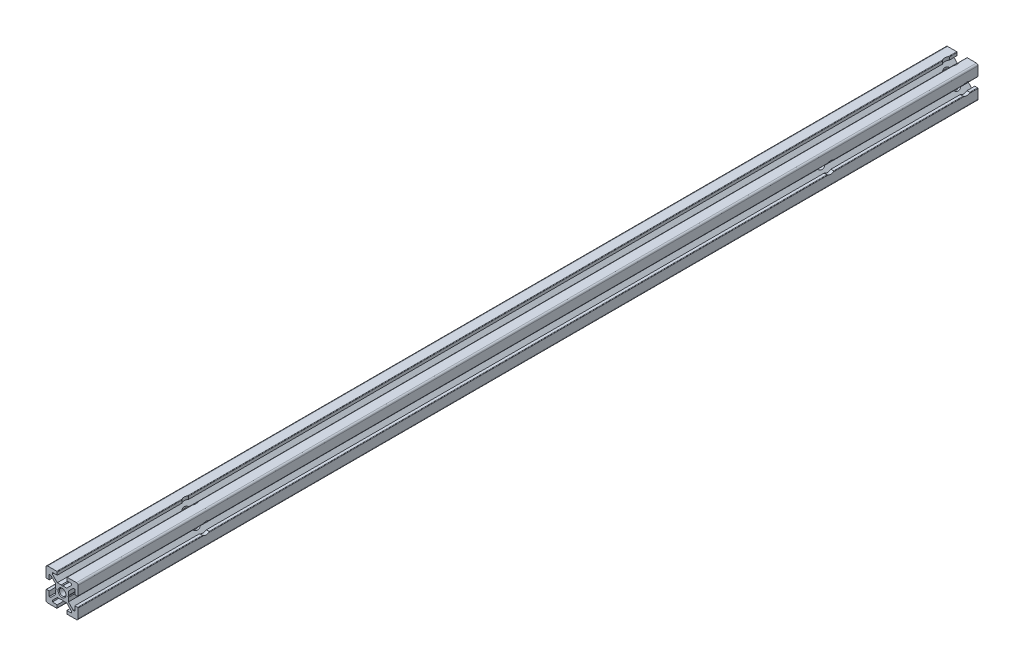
from build123d import *

# Parameters (mm, degrees)
BOSS_EXTRUDE1_DEPTH     = 562
CUT_EXTRUDE1_DEPTH      = 10
CUT_EXTRUDE1_DEPTH_BACK = 10
SKETCH3_R               = 3.675
CUT_EXTRUDE2_DEPTH      = 10
CUT_EXTRUDE2_DEPTH_BACK = 10
SKETCH4_R               = 3.675
CUT_EXTRUDE3_DEPTH      = 10
CUT_EXTRUDE3_DEPTH_BACK = 10
SKETCH5_R               = 3.6751
CUT_EXTRUDE4_DEPTH      = 10
CUT_EXTRUDE4_DEPTH_BACK = 10
SKETCH6_R               = 3.6752
CUT_EXTRUDE5_DEPTH      = 10
CUT_EXTRUDE5_DEPTH_BACK = 10
SKETCH7_R               = 3.6752


with BuildPart() as part:
    # Sketch1 → Boss-Extrude1 (new body)
    with BuildSketch(Plane.XY):
        with BuildLine():
            Line((-10, 9), (-10, 3.29999995))
            ThreePointArc((-10, 3.29999995), (-9.912132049, 3.087867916), (-9.7, 3))
            Line((-9.7, 3), (-8, 3))
            Line((-8, 3), (-8, 6))
            Line((-8, 6), (-7.060677, 6))
            Line((-7.060677, 6), (-4, 2.93932965))
            Line((-4, 2.93932965), (-4, 0.519615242))
            Line((-4, 0.519615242), (-3.699996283, -6.437e-06))
            Line((-3.699996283, -6.437e-06), (-4, -0.519628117))
            Line((-4, -0.519628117), (-4, -2.93933725))
            Line((-4, -2.93933725), (-7.0606695, -6))
            Line((-7.0606695, -6), (-8, -6))
            Line((-8, -6), (-8, -3))
            Line((-8, -3), (-9.7, -3))
            ThreePointArc((-9.7, -3), (-9.912132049, -3.087867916), (-10, -3.29999995))
            Line((-10, -3.29999995), (-10, -9))
            ThreePointArc((-10, -9), (-9.707106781, -9.707106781), (-9, -10))
            Line((-9, -10), (-3.29999995, -10))
            ThreePointArc((-3.29999995, -10), (-3.087867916, -9.912132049), (-3, -9.7))
            Line((-3, -9.7), (-3, -8))
            Line((-3, -8), (-6, -8))
            Line((-6, -8), (-6, -7.0606515))
            Line((-6, -7.0606515), (-2.9393489, -4))
            Line((-2.9393489, -4), (-0.519615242, -4))
            Line((-0.519615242, -4), (6.437e-06, -3.699996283))
            Line((6.437e-06, -3.699996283), (0.519628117, -4))
            Line((0.519628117, -4), (2.9393227, -4))
            Line((2.9393227, -4), (6, -7.060677))
            Line((6, -7.060677), (6, -8))
            Line((6, -8), (3, -8))
            Line((3, -8), (3, -9.7))
            ThreePointArc((3, -9.7), (3.087867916, -9.912132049), (3.29999995, -10))
            Line((3.29999995, -10), (9, -10))
            ThreePointArc((9, -10), (9.707106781, -9.707106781), (10, -9))
            Line((10, -9), (10, -3.29999995))
            ThreePointArc((10, -3.29999995), (9.912132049, -3.087867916), (9.7, -3))
            Line((9.7, -3), (8, -3))
            Line((8, -3), (8, -6))
            Line((8, -6), (7.0606435, -6))
            Line((7.0606435, -6), (4, -2.9393482))
            Line((4, -2.9393482), (4, -0.519615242))
            Line((4, -0.519615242), (3.699996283, 6.437e-06))
            Line((3.699996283, 6.437e-06), (4, 0.519628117))
            Line((4, 0.519628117), (4, 2.9393401))
            Line((4, 2.9393401), (7.060651, 6))
            Line((7.060651, 6), (8, 6))
            Line((8, 6), (8, 3))
            Line((8, 3), (9.7, 3))
            ThreePointArc((9.7, 3), (9.912132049, 3.087867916), (10, 3.29999995))
            Line((10, 3.29999995), (10, 9))
            ThreePointArc((10, 9), (9.707106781, 9.707106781), (9, 10))
            Line((9, 10), (3.29999995, 10))
            ThreePointArc((3.29999995, 10), (3.087867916, 9.912132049), (3, 9.7))
            Line((3, 9.7), (3, 8))
            Line((3, 8), (6, 8))
            Line((6, 8), (6, 7.060669))
            Line((6, 7.060669), (2.9393308, 4))
            Line((2.9393308, 4), (0.519615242, 4))
            Line((0.519615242, 4), (-6.437e-06, 3.699996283))
            Line((-6.437e-06, 3.699996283), (-0.519628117, 4))
            Line((-0.519628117, 4), (-2.93935655, 4))
            Line((-2.93935655, 4), (-6, 7.0606435))
            Line((-6, 7.0606435), (-6, 8))
            Line((-6, 8), (-3, 8))
            Line((-3, 8), (-3, 9.7))
            ThreePointArc((-3, 9.7), (-3.087867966, 9.912132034), (-3.3, 10))
            Line((-3.3, 10), (-9, 10))
            ThreePointArc((-9, 10), (-9.707106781, 9.707106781), (-10, 9))
        make_face()
    extrude(amount=-BOSS_EXTRUDE1_DEPTH)

    # Sketch2 → Cut-Revolve1 (revolve, cut)
    with BuildSketch(Plane(origin=(0, 0, 0), x_dir=(0, 0, -1), z_dir=(1, 0, 0)), mode=Mode.PRIVATE) as cut_revolve1_sk:
        Polygon((0, 0), (0, 2.5), (0.433, 2.067), (562, 2.067), (562, 0), align=None)
    revolve(cut_revolve1_sk.sketch.rotate(Axis((0, 0, -562), (0, 0, 1)), 270), axis=Axis((0, 0, -562), (0, 0, 1)), mode=Mode.SUBTRACT)

    # Sketch3 → Cut-Extrude1 (cut, two sides: drawn at the far end of the back side and taken through both)
    with BuildSketch(Plane(origin=(0, 0, 0), x_dir=(0, 0, -1), z_dir=(1, 0, 0)).offset(-CUT_EXTRUDE1_DEPTH_BACK)):
        with Locations(Location((555, 6.437e-06, 0), (0, 0, 180))):
            Circle(SKETCH3_R)
    extrude(amount=CUT_EXTRUDE1_DEPTH + CUT_EXTRUDE1_DEPTH_BACK, mode=Mode.SUBTRACT)

    # Sketch4 → Cut-Extrude2 (cut, two sides: drawn at the far end of the back side and taken through both)
    with BuildSketch(Plane(origin=(0, 0, 0), x_dir=(1, 0, 0), z_dir=(0, 1, 0)).offset(-CUT_EXTRUDE2_DEPTH_BACK)):
        with Locations(Location((6.437e-06, 555, 0), (0, 0, 90))):
            Circle(SKETCH4_R)
    extrude(amount=CUT_EXTRUDE2_DEPTH + CUT_EXTRUDE2_DEPTH_BACK, mode=Mode.SUBTRACT)

    # Sketch5 → Cut-Extrude3 (cut, two sides: drawn at the far end of the back side and taken through both)
    with BuildSketch(Plane(origin=(0, 0, 0), x_dir=(0, 0, -1), z_dir=(1, 0, 0)).offset(-CUT_EXTRUDE3_DEPTH_BACK)):
        with Locations(Location((470, 6.437e-06, 0), (0, 0, 180))):
            Circle(SKETCH5_R)
    extrude(amount=CUT_EXTRUDE3_DEPTH + CUT_EXTRUDE3_DEPTH_BACK, mode=Mode.SUBTRACT)

    # Sketch6 → Cut-Extrude4 (cut, two sides: drawn at the far end of the back side and taken through both)
    with BuildSketch(Plane(origin=(0, 0, 0), x_dir=(0, 0, -1), z_dir=(1, 0, 0)).offset(-CUT_EXTRUDE4_DEPTH_BACK)):
        with Locations(Location((80, 6.437e-06, 0), (0, 0, 180))):
            Circle(SKETCH6_R)
    extrude(amount=CUT_EXTRUDE4_DEPTH + CUT_EXTRUDE4_DEPTH_BACK, mode=Mode.SUBTRACT)

    # Sketch7 → Cut-Extrude5 (cut, two sides: drawn at the far end of the back side and taken through both)
    with BuildSketch(Plane(origin=(0, 0, 0), x_dir=(1, 0, 0), z_dir=(0, 1, 0)).offset(-CUT_EXTRUDE5_DEPTH_BACK)):
        with Locations(Location((-6.437e-06, 80, 0), (0, 0, 89.999799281))):
            Circle(SKETCH7_R)
    extrude(amount=CUT_EXTRUDE5_DEPTH + CUT_EXTRUDE5_DEPTH_BACK, mode=Mode.SUBTRACT)


solid = part.part
